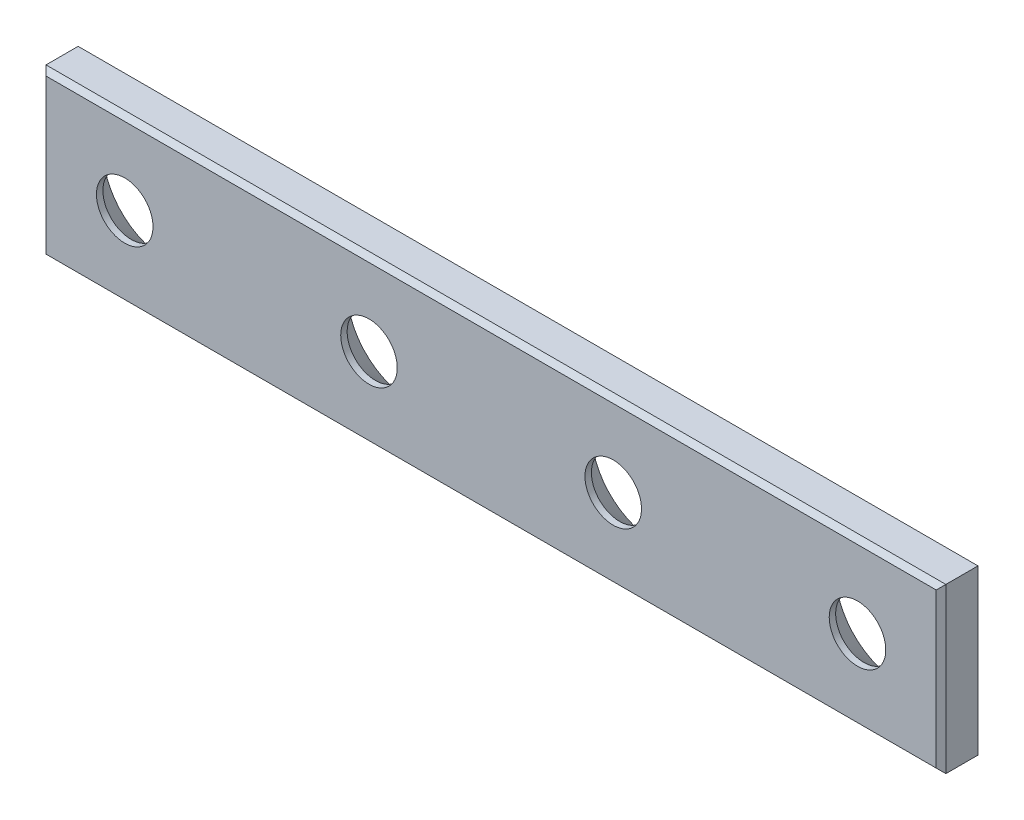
ISO-10303-21;
HEADER;
FILE_DESCRIPTION(('STEP AP214'),'2;1');
FILE_NAME('part.step','',(''),(''),'','','');
FILE_SCHEMA(('AUTOMOTIVE_DESIGN { 1 0 10303 214 1 1 1 1 }'));
ENDSEC;
DATA;
#1=APPLICATION_CONTEXT('core data for automotive mechanical design processes');
#2=APPLICATION_PROTOCOL_DEFINITION('international standard','automotive_design',2000,#1);
#3=PRODUCT_CONTEXT('',#1,'mechanical');
#4=PRODUCT('Part','Part','',(#3));
#5=PRODUCT_RELATED_PRODUCT_CATEGORY('part','',(#4));
#6=PRODUCT_DEFINITION_FORMATION('','',#4);
#7=PRODUCT_DEFINITION_CONTEXT('part definition',#1,'design');
#8=PRODUCT_DEFINITION('design','',#6,#7);
#9=PRODUCT_DEFINITION_SHAPE('','',#8);
#10=(LENGTH_UNIT() NAMED_UNIT(*) SI_UNIT(.MILLI.,.METRE.));
#11=(NAMED_UNIT(*) PLANE_ANGLE_UNIT() SI_UNIT($,.RADIAN.));
#12=(NAMED_UNIT(*) SI_UNIT($,.STERADIAN.) SOLID_ANGLE_UNIT());
#13=UNCERTAINTY_MEASURE_WITH_UNIT(LENGTH_MEASURE(1.E-05),#10,'distance_accuracy_value','');
#14=(GEOMETRIC_REPRESENTATION_CONTEXT(3) GLOBAL_UNCERTAINTY_ASSIGNED_CONTEXT((#13)) GLOBAL_UNIT_ASSIGNED_CONTEXT((#10,
#11,#12)) REPRESENTATION_CONTEXT('',''));
#15=CARTESIAN_POINT('',(0.,0.,0.));
#16=DIRECTION('',(0.,0.,1.));
#17=DIRECTION('',(1.,0.,0.));
#18=AXIS2_PLACEMENT_3D('',#15,#16,#17);
#19=CARTESIAN_POINT('',(70.,-12.75,6.5));
#20=DIRECTION('',(-1.,0.,0.));
#21=DIRECTION('',(0.,0.,1.));
#22=AXIS2_PLACEMENT_3D('',#19,#20,#21);
#23=PLANE('',#22);
#24=DIRECTION('',(0.,0.,-1.));
#25=VECTOR('',#24,1.);
#26=CARTESIAN_POINT('',(70.,12.75,6.5));
#27=LINE('',#26,#25);
#28=CARTESIAN_POINT('',(70.,12.75,5.75));
#29=VERTEX_POINT('',#28);
#30=CARTESIAN_POINT('',(70.,12.75,0.750000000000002));
#31=VERTEX_POINT('',#30);
#32=EDGE_CURVE('E120',#29,#31,#27,.T.);
#33=ORIENTED_EDGE('',*,*,#32,.F.);
#34=DIRECTION('',(0.,-1.,0.));
#35=VECTOR('',#34,1.);
#36=CARTESIAN_POINT('',(70.,-12.75,5.75));
#37=LINE('',#36,#35);
#38=CARTESIAN_POINT('',(70.,-12.75,5.75));
#39=VERTEX_POINT('',#38);
#40=EDGE_CURVE('E144',#29,#39,#37,.T.);
#41=ORIENTED_EDGE('',*,*,#40,.T.);
#42=DIRECTION('',(0.,0.,-1.));
#43=VECTOR('',#42,1.);
#44=CARTESIAN_POINT('',(70.,-12.75,6.5));
#45=LINE('',#44,#43);
#46=CARTESIAN_POINT('',(70.,-12.75,0.750000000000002));
#47=VERTEX_POINT('',#46);
#48=EDGE_CURVE('E158',#39,#47,#45,.T.);
#49=ORIENTED_EDGE('',*,*,#48,.T.);
#50=DIRECTION('',(0.,1.,0.));
#51=VECTOR('',#50,1.);
#52=CARTESIAN_POINT('',(70.,12.75,0.750000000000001));
#53=LINE('',#52,#51);
#54=EDGE_CURVE('E142',#47,#31,#53,.T.);
#55=ORIENTED_EDGE('',*,*,#54,.T.);
#56=EDGE_LOOP('',(#33,#41,#49,#55));
#57=FACE_BOUND('',#56,.T.);
#58=ADVANCED_FACE('F34',(#57),#23,.F.);
#59=CARTESIAN_POINT('',(-70.,12.75,6.5));
#60=DIRECTION('',(0.,-1.,0.));
#61=DIRECTION('',(0.,0.,-1.));
#62=AXIS2_PLACEMENT_3D('',#59,#60,#61);
#63=PLANE('',#62);
#64=DIRECTION('',(0.,0.,-1.));
#65=VECTOR('',#64,1.);
#66=CARTESIAN_POINT('',(-70.,12.75,6.5));
#67=LINE('',#66,#65);
#68=CARTESIAN_POINT('',(-70.,12.75,5.75));
#69=VERTEX_POINT('',#68);
#70=CARTESIAN_POINT('',(-70.,12.75,0.750000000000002));
#71=VERTEX_POINT('',#70);
#72=EDGE_CURVE('E278',#69,#71,#67,.T.);
#73=ORIENTED_EDGE('',*,*,#72,.F.);
#74=DIRECTION('',(1.,0.,0.));
#75=VECTOR('',#74,1.);
#76=CARTESIAN_POINT('',(-70.,12.75,5.75));
#77=LINE('',#76,#75);
#78=EDGE_CURVE('E140',#69,#29,#77,.T.);
#79=ORIENTED_EDGE('',*,*,#78,.T.);
#80=ORIENTED_EDGE('',*,*,#32,.T.);
#81=DIRECTION('',(-1.,0.,0.));
#82=VECTOR('',#81,1.);
#83=CARTESIAN_POINT('',(-70.,12.75,0.750000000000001));
#84=LINE('',#83,#82);
#85=EDGE_CURVE('E137',#31,#71,#84,.T.);
#86=ORIENTED_EDGE('',*,*,#85,.T.);
#87=EDGE_LOOP('',(#73,#79,#80,#86));
#88=FACE_BOUND('',#87,.T.);
#89=ADVANCED_FACE('F205',(#88),#63,.F.);
#90=CARTESIAN_POINT('',(-70.,-12.75,6.5));
#91=DIRECTION('',(1.,0.,0.));
#92=DIRECTION('',(0.,0.,-1.));
#93=AXIS2_PLACEMENT_3D('',#90,#91,#92);
#94=PLANE('',#93);
#95=DIRECTION('',(0.,0.,-1.));
#96=VECTOR('',#95,1.);
#97=CARTESIAN_POINT('',(-70.,-12.75,6.5));
#98=LINE('',#97,#96);
#99=CARTESIAN_POINT('',(-70.,-12.75,5.75));
#100=VERTEX_POINT('',#99);
#101=CARTESIAN_POINT('',(-70.,-12.75,0.750000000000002));
#102=VERTEX_POINT('',#101);
#103=EDGE_CURVE('E275',#100,#102,#98,.T.);
#104=ORIENTED_EDGE('',*,*,#103,.F.);
#105=DIRECTION('',(0.,1.,0.));
#106=VECTOR('',#105,1.);
#107=CARTESIAN_POINT('',(-70.,-12.75,5.75));
#108=LINE('',#107,#106);
#109=EDGE_CURVE('E135',#100,#69,#108,.T.);
#110=ORIENTED_EDGE('',*,*,#109,.T.);
#111=ORIENTED_EDGE('',*,*,#72,.T.);
#112=DIRECTION('',(0.,-1.,0.));
#113=VECTOR('',#112,1.);
#114=CARTESIAN_POINT('',(-70.,-12.75,0.750000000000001));
#115=LINE('',#114,#113);
#116=EDGE_CURVE('E133',#71,#102,#115,.T.);
#117=ORIENTED_EDGE('',*,*,#116,.T.);
#118=EDGE_LOOP('',(#104,#110,#111,#117));
#119=FACE_BOUND('',#118,.T.);
#120=ADVANCED_FACE('F211',(#119),#94,.F.);
#121=CARTESIAN_POINT('',(-70.,-12.75,6.5));
#122=DIRECTION('',(0.,1.,0.));
#123=DIRECTION('',(0.,0.,1.));
#124=AXIS2_PLACEMENT_3D('',#121,#122,#123);
#125=PLANE('',#124);
#126=ORIENTED_EDGE('',*,*,#48,.F.);
#127=DIRECTION('',(-1.,0.,0.));
#128=VECTOR('',#127,1.);
#129=CARTESIAN_POINT('',(-70.,-12.75,5.75));
#130=LINE('',#129,#128);
#131=EDGE_CURVE('E106',#39,#100,#130,.T.);
#132=ORIENTED_EDGE('',*,*,#131,.T.);
#133=ORIENTED_EDGE('',*,*,#103,.T.);
#134=DIRECTION('',(1.,0.,0.));
#135=VECTOR('',#134,1.);
#136=CARTESIAN_POINT('',(70.,-12.75,0.750000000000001));
#137=LINE('',#136,#135);
#138=EDGE_CURVE('E126',#102,#47,#137,.T.);
#139=ORIENTED_EDGE('',*,*,#138,.T.);
#140=EDGE_LOOP('',(#126,#132,#133,#139));
#141=FACE_BOUND('',#140,.T.);
#142=ADVANCED_FACE('F290',(#141),#125,.F.);
#143=CARTESIAN_POINT('',(70.,12.75,6.5));
#144=DIRECTION('',(0.,0.,-1.));
#145=DIRECTION('',(-1.,0.,0.));
#146=AXIS2_PLACEMENT_3D('',#143,#144,#145);
#147=PLANE('',#146);
#148=CARTESIAN_POINT('',(57.,0.,6.5));
#149=DIRECTION('',(0.,0.,-1.));
#150=DIRECTION('',(-1.,0.,0.));
#151=AXIS2_PLACEMENT_3D('',#148,#149,#150);
#152=CIRCLE('',#151,4.4);
#153=CARTESIAN_POINT('',(52.6,0.,6.5));
#154=VERTEX_POINT('',#153);
#155=EDGE_CURVE('E454',#154,#154,#152,.T.);
#156=ORIENTED_EDGE('',*,*,#155,.T.);
#157=EDGE_LOOP('',(#156));
#158=FACE_BOUND('',#157,.T.);
#159=CARTESIAN_POINT('',(19.,0.,6.5));
#160=DIRECTION('',(0.,0.,-1.));
#161=DIRECTION('',(-1.,0.,0.));
#162=AXIS2_PLACEMENT_3D('',#159,#160,#161);
#163=CIRCLE('',#162,4.4);
#164=CARTESIAN_POINT('',(14.6,0.,6.5));
#165=VERTEX_POINT('',#164);
#166=EDGE_CURVE('E269',#165,#165,#163,.T.);
#167=ORIENTED_EDGE('',*,*,#166,.T.);
#168=EDGE_LOOP('',(#167));
#169=FACE_BOUND('',#168,.T.);
#170=CARTESIAN_POINT('',(-19.,0.,6.5));
#171=DIRECTION('',(0.,0.,-1.));
#172=DIRECTION('',(-1.,0.,0.));
#173=AXIS2_PLACEMENT_3D('',#170,#171,#172);
#174=CIRCLE('',#173,4.4);
#175=CARTESIAN_POINT('',(-23.4,0.,6.5));
#176=VERTEX_POINT('',#175);
#177=EDGE_CURVE('E266',#176,#176,#174,.T.);
#178=ORIENTED_EDGE('',*,*,#177,.T.);
#179=EDGE_LOOP('',(#178));
#180=FACE_BOUND('',#179,.T.);
#181=CARTESIAN_POINT('',(-57.,0.,6.5));
#182=DIRECTION('',(0.,0.,-1.));
#183=DIRECTION('',(-1.,0.,0.));
#184=AXIS2_PLACEMENT_3D('',#181,#182,#183);
#185=CIRCLE('',#184,4.4);
#186=CARTESIAN_POINT('',(-61.4,0.,6.5));
#187=VERTEX_POINT('',#186);
#188=EDGE_CURVE('E162',#187,#187,#185,.T.);
#189=ORIENTED_EDGE('',*,*,#188,.T.);
#190=EDGE_LOOP('',(#189));
#191=FACE_BOUND('',#190,.T.);
#192=DIRECTION('',(0.,-1.,0.));
#193=VECTOR('',#192,1.);
#194=CARTESIAN_POINT('',(-69.25,12.75,6.5));
#195=LINE('',#194,#193);
#196=CARTESIAN_POINT('',(-69.25,12.,6.5));
#197=VERTEX_POINT('',#196);
#198=CARTESIAN_POINT('',(-69.25,-12.,6.5));
#199=VERTEX_POINT('',#198);
#200=EDGE_CURVE('E124',#197,#199,#195,.T.);
#201=ORIENTED_EDGE('',*,*,#200,.T.);
#202=DIRECTION('',(1.,0.,0.));
#203=VECTOR('',#202,1.);
#204=CARTESIAN_POINT('',(70.,-12.,6.5));
#205=LINE('',#204,#203);
#206=CARTESIAN_POINT('',(69.25,-12.,6.5));
#207=VERTEX_POINT('',#206);
#208=EDGE_CURVE('E104',#199,#207,#205,.T.);
#209=ORIENTED_EDGE('',*,*,#208,.T.);
#210=DIRECTION('',(0.,1.,0.));
#211=VECTOR('',#210,1.);
#212=CARTESIAN_POINT('',(69.25,12.75,6.5));
#213=LINE('',#212,#211);
#214=CARTESIAN_POINT('',(69.25,12.,6.5));
#215=VERTEX_POINT('',#214);
#216=EDGE_CURVE('E113',#207,#215,#213,.T.);
#217=ORIENTED_EDGE('',*,*,#216,.T.);
#218=DIRECTION('',(-1.,0.,0.));
#219=VECTOR('',#218,1.);
#220=CARTESIAN_POINT('',(70.,12.,6.5));
#221=LINE('',#220,#219);
#222=EDGE_CURVE('E119',#215,#197,#221,.T.);
#223=ORIENTED_EDGE('',*,*,#222,.T.);
#224=EDGE_LOOP('',(#201,#209,#217,#223));
#225=FACE_BOUND('',#224,.T.);
#226=ADVANCED_FACE('F122',(#158,#169,#180,#191,#225),#147,.F.);
#227=CARTESIAN_POINT('',(70.,12.75,0.));
#228=DIRECTION('',(0.,0.,-1.));
#229=DIRECTION('',(-1.,0.,0.));
#230=AXIS2_PLACEMENT_3D('',#227,#228,#229);
#231=PLANE('',#230);
#232=CARTESIAN_POINT('',(-57.,0.,0.));
#233=DIRECTION('',(0.,0.,-1.));
#234=DIRECTION('',(-1.,0.,0.));
#235=AXIS2_PLACEMENT_3D('',#232,#233,#234);
#236=CIRCLE('',#235,9.90000000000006);
#237=CARTESIAN_POINT('',(-66.9000000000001,0.,0.));
#238=VERTEX_POINT('',#237);
#239=EDGE_CURVE('E180',#238,#238,#236,.F.);
#240=ORIENTED_EDGE('',*,*,#239,.T.);
#241=EDGE_LOOP('',(#240));
#242=FACE_BOUND('',#241,.T.);
#243=CARTESIAN_POINT('',(-19.,0.,0.));
#244=DIRECTION('',(0.,0.,-1.));
#245=DIRECTION('',(-1.,0.,0.));
#246=AXIS2_PLACEMENT_3D('',#243,#244,#245);
#247=CIRCLE('',#246,9.90000000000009);
#248=CARTESIAN_POINT('',(-28.9000000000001,0.,0.));
#249=VERTEX_POINT('',#248);
#250=EDGE_CURVE('E177',#249,#249,#247,.F.);
#251=ORIENTED_EDGE('',*,*,#250,.T.);
#252=EDGE_LOOP('',(#251));
#253=FACE_BOUND('',#252,.T.);
#254=CARTESIAN_POINT('',(19.,0.,0.));
#255=DIRECTION('',(0.,0.,-1.));
#256=DIRECTION('',(-1.,0.,0.));
#257=AXIS2_PLACEMENT_3D('',#254,#255,#256);
#258=CIRCLE('',#257,9.90000000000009);
#259=CARTESIAN_POINT('',(9.09999999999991,0.,0.));
#260=VERTEX_POINT('',#259);
#261=EDGE_CURVE('E174',#260,#260,#258,.F.);
#262=ORIENTED_EDGE('',*,*,#261,.T.);
#263=EDGE_LOOP('',(#262));
#264=FACE_BOUND('',#263,.T.);
#265=CARTESIAN_POINT('',(57.,0.,0.));
#266=DIRECTION('',(0.,0.,-1.));
#267=DIRECTION('',(-1.,0.,0.));
#268=AXIS2_PLACEMENT_3D('',#265,#266,#267);
#269=CIRCLE('',#268,9.9000000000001);
#270=CARTESIAN_POINT('',(47.0999999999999,0.,0.));
#271=VERTEX_POINT('',#270);
#272=EDGE_CURVE('E171',#271,#271,#269,.F.);
#273=ORIENTED_EDGE('',*,*,#272,.T.);
#274=EDGE_LOOP('',(#273));
#275=FACE_BOUND('',#274,.T.);
#276=DIRECTION('',(0.,1.,0.));
#277=VECTOR('',#276,1.);
#278=CARTESIAN_POINT('',(-69.25,12.75,0.));
#279=LINE('',#278,#277);
#280=CARTESIAN_POINT('',(-69.25,-12.,0.));
#281=VERTEX_POINT('',#280);
#282=CARTESIAN_POINT('',(-69.25,12.,0.));
#283=VERTEX_POINT('',#282);
#284=EDGE_CURVE('E49',#281,#283,#279,.T.);
#285=ORIENTED_EDGE('',*,*,#284,.T.);
#286=DIRECTION('',(1.,0.,0.));
#287=VECTOR('',#286,1.);
#288=CARTESIAN_POINT('',(70.,12.,0.));
#289=LINE('',#288,#287);
#290=CARTESIAN_POINT('',(69.25,12.,0.));
#291=VERTEX_POINT('',#290);
#292=EDGE_CURVE('E150',#283,#291,#289,.T.);
#293=ORIENTED_EDGE('',*,*,#292,.T.);
#294=DIRECTION('',(0.,-1.,0.));
#295=VECTOR('',#294,1.);
#296=CARTESIAN_POINT('',(69.25,-12.75,0.));
#297=LINE('',#296,#295);
#298=CARTESIAN_POINT('',(69.25,-12.,0.));
#299=VERTEX_POINT('',#298);
#300=EDGE_CURVE('E146',#291,#299,#297,.T.);
#301=ORIENTED_EDGE('',*,*,#300,.T.);
#302=DIRECTION('',(-1.,0.,0.));
#303=VECTOR('',#302,1.);
#304=CARTESIAN_POINT('',(-70.,-12.,0.));
#305=LINE('',#304,#303);
#306=EDGE_CURVE('E54',#299,#281,#305,.T.);
#307=ORIENTED_EDGE('',*,*,#306,.T.);
#308=EDGE_LOOP('',(#285,#293,#301,#307));
#309=FACE_BOUND('',#308,.T.);
#310=ADVANCED_FACE('F229',(#242,#253,#264,#275,#309),#231,.T.);
#311=CARTESIAN_POINT('',(70.,12.,6.5));
#312=DIRECTION('',(0.,-0.707106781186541,-0.707106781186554));
#313=DIRECTION('',(0.,0.707106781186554,-0.707106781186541));
#314=AXIS2_PLACEMENT_3D('',#311,#312,#313);
#315=PLANE('',#314);
#316=DIRECTION('',(-0.577350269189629,-0.577350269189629,0.577350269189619));
#317=VECTOR('',#316,1.);
#318=CARTESIAN_POINT('',(69.5,12.25,6.25));
#319=LINE('',#318,#317);
#320=EDGE_CURVE('E116',#29,#215,#319,.T.);
#321=ORIENTED_EDGE('',*,*,#320,.F.);
#322=ORIENTED_EDGE('',*,*,#78,.F.);
#323=DIRECTION('',(0.577350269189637,-0.577350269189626,0.577350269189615));
#324=VECTOR('',#323,1.);
#325=CARTESIAN_POINT('',(-22.8333333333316,-34.4166666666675,52.9166666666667));
#326=LINE('',#325,#324);
#327=EDGE_CURVE('E155',#197,#69,#326,.F.);
#328=ORIENTED_EDGE('',*,*,#327,.F.);
#329=ORIENTED_EDGE('',*,*,#222,.F.);
#330=EDGE_LOOP('',(#321,#322,#328,#329));
#331=FACE_BOUND('',#330,.T.);
#332=ADVANCED_FACE('F225',(#331),#315,.F.);
#333=CARTESIAN_POINT('',(-69.25,12.75,6.5));
#334=DIRECTION('',(0.707106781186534,0.,-0.707106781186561));
#335=DIRECTION('',(-0.707106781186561,0.,-0.707106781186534));
#336=AXIS2_PLACEMENT_3D('',#333,#334,#335);
#337=PLANE('',#336);
#338=ORIENTED_EDGE('',*,*,#327,.T.);
#339=ORIENTED_EDGE('',*,*,#109,.F.);
#340=DIRECTION('',(0.577350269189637,0.577350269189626,0.577350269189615));
#341=VECTOR('',#340,1.);
#342=CARTESIAN_POINT('',(-60.9999999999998,-3.74999999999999,14.7499999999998));
#343=LINE('',#342,#341);
#344=EDGE_CURVE('E109',#199,#100,#343,.F.);
#345=ORIENTED_EDGE('',*,*,#344,.F.);
#346=ORIENTED_EDGE('',*,*,#200,.F.);
#347=EDGE_LOOP('',(#338,#339,#345,#346));
#348=FACE_BOUND('',#347,.T.);
#349=ADVANCED_FACE('F222',(#348),#337,.F.);
#350=CARTESIAN_POINT('',(69.25,12.75,6.5));
#351=DIRECTION('',(-0.707106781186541,0.,-0.707106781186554));
#352=DIRECTION('',(-0.707106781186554,0.,0.707106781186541));
#353=AXIS2_PLACEMENT_3D('',#350,#351,#352);
#354=PLANE('',#353);
#355=ORIENTED_EDGE('',*,*,#320,.T.);
#356=ORIENTED_EDGE('',*,*,#216,.F.);
#357=DIRECTION('',(0.577350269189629,-0.577350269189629,-0.577350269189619));
#358=VECTOR('',#357,1.);
#359=CARTESIAN_POINT('',(60.9999999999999,-3.74999999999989,14.7499999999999));
#360=LINE('',#359,#358);
#361=EDGE_CURVE('E100',#39,#207,#360,.F.);
#362=ORIENTED_EDGE('',*,*,#361,.F.);
#363=ORIENTED_EDGE('',*,*,#40,.F.);
#364=EDGE_LOOP('',(#355,#356,#362,#363));
#365=FACE_BOUND('',#364,.T.);
#366=ADVANCED_FACE('F114',(#365),#354,.F.);
#367=CARTESIAN_POINT('',(70.,-12.,6.5));
#368=DIRECTION('',(0.,0.707106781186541,-0.707106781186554));
#369=DIRECTION('',(0.,0.707106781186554,0.707106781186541));
#370=AXIS2_PLACEMENT_3D('',#367,#368,#369);
#371=PLANE('',#370);
#372=ORIENTED_EDGE('',*,*,#344,.T.);
#373=ORIENTED_EDGE('',*,*,#131,.F.);
#374=ORIENTED_EDGE('',*,*,#361,.T.);
#375=ORIENTED_EDGE('',*,*,#208,.F.);
#376=EDGE_LOOP('',(#372,#373,#374,#375));
#377=FACE_BOUND('',#376,.T.);
#378=ADVANCED_FACE('F102',(#377),#371,.F.);
#379=CARTESIAN_POINT('',(-70.,-12.75,0.750000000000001));
#380=DIRECTION('',(0.,-0.707106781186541,-0.707106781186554));
#381=DIRECTION('',(0.,0.707106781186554,-0.707106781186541));
#382=AXIS2_PLACEMENT_3D('',#379,#380,#381);
#383=PLANE('',#382);
#384=DIRECTION('',(0.577350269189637,0.577350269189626,-0.577350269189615));
#385=VECTOR('',#384,1.);
#386=CARTESIAN_POINT('',(-70.,-12.75,0.750000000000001));
#387=LINE('',#386,#385);
#388=EDGE_CURVE('E164',#281,#102,#387,.F.);
#389=ORIENTED_EDGE('',*,*,#388,.F.);
#390=ORIENTED_EDGE('',*,*,#306,.F.);
#391=DIRECTION('',(-0.577350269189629,0.577350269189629,-0.577350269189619));
#392=VECTOR('',#391,1.);
#393=CARTESIAN_POINT('',(70.,-12.75,0.750000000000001));
#394=LINE('',#393,#392);
#395=EDGE_CURVE('E110',#47,#299,#394,.T.);
#396=ORIENTED_EDGE('',*,*,#395,.F.);
#397=ORIENTED_EDGE('',*,*,#138,.F.);
#398=EDGE_LOOP('',(#389,#390,#396,#397));
#399=FACE_BOUND('',#398,.T.);
#400=ADVANCED_FACE('F219',(#399),#383,.T.);
#401=CARTESIAN_POINT('',(70.,-12.75,0.750000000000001));
#402=DIRECTION('',(0.707106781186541,0.,-0.707106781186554));
#403=DIRECTION('',(-0.707106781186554,0.,-0.707106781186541));
#404=AXIS2_PLACEMENT_3D('',#401,#402,#403);
#405=PLANE('',#404);
#406=ORIENTED_EDGE('',*,*,#395,.T.);
#407=ORIENTED_EDGE('',*,*,#300,.F.);
#408=DIRECTION('',(0.577350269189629,0.577350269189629,0.577350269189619));
#409=VECTOR('',#408,1.);
#410=CARTESIAN_POINT('',(61.4999999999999,4.24999999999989,-7.74999999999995));
#411=LINE('',#410,#409);
#412=EDGE_CURVE('E161',#31,#291,#411,.F.);
#413=ORIENTED_EDGE('',*,*,#412,.F.);
#414=ORIENTED_EDGE('',*,*,#54,.F.);
#415=EDGE_LOOP('',(#406,#407,#413,#414));
#416=FACE_BOUND('',#415,.T.);
#417=ADVANCED_FACE('F239',(#416),#405,.T.);
#418=CARTESIAN_POINT('',(-70.,-12.75,0.750000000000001));
#419=DIRECTION('',(-0.707106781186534,0.,-0.707106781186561));
#420=DIRECTION('',(-0.707106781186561,0.,0.707106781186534));
#421=AXIS2_PLACEMENT_3D('',#418,#419,#420);
#422=PLANE('',#421);
#423=ORIENTED_EDGE('',*,*,#388,.T.);
#424=ORIENTED_EDGE('',*,*,#116,.F.);
#425=DIRECTION('',(0.577350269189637,-0.577350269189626,-0.577350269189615));
#426=VECTOR('',#425,1.);
#427=CARTESIAN_POINT('',(-61.4999999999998,4.25,-7.74999999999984));
#428=LINE('',#427,#426);
#429=EDGE_CURVE('E159',#283,#71,#428,.F.);
#430=ORIENTED_EDGE('',*,*,#429,.F.);
#431=ORIENTED_EDGE('',*,*,#284,.F.);
#432=EDGE_LOOP('',(#423,#424,#430,#431));
#433=FACE_BOUND('',#432,.T.);
#434=ADVANCED_FACE('F235',(#433),#422,.T.);
#435=CARTESIAN_POINT('',(-70.,12.75,0.750000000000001));
#436=DIRECTION('',(0.,0.707106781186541,-0.707106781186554));
#437=DIRECTION('',(0.,0.707106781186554,0.707106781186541));
#438=AXIS2_PLACEMENT_3D('',#435,#436,#437);
#439=PLANE('',#438);
#440=ORIENTED_EDGE('',*,*,#412,.T.);
#441=ORIENTED_EDGE('',*,*,#292,.F.);
#442=ORIENTED_EDGE('',*,*,#429,.T.);
#443=ORIENTED_EDGE('',*,*,#85,.F.);
#444=EDGE_LOOP('',(#440,#441,#442,#443));
#445=FACE_BOUND('',#444,.T.);
#446=ADVANCED_FACE('F231',(#445),#439,.T.);
#447=CARTESIAN_POINT('',(-57.,0.,6.5));
#448=DIRECTION('',(0.,0.,-1.));
#449=DIRECTION('',(-1.,0.,0.));
#450=AXIS2_PLACEMENT_3D('',#447,#448,#449);
#451=CYLINDRICAL_SURFACE('',#450,4.4);
#452=CARTESIAN_POINT('',(-57.,0.,5.50000000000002));
#453=DIRECTION('',(0.,0.,-1.));
#454=DIRECTION('',(-1.,0.,0.));
#455=AXIS2_PLACEMENT_3D('',#452,#453,#454);
#456=CIRCLE('',#455,4.4);
#457=CARTESIAN_POINT('',(-61.4,0.,5.50000000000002));
#458=VERTEX_POINT('',#457);
#459=EDGE_CURVE('E151',#458,#458,#456,.T.);
#460=CARTESIAN_POINT('',(-61.4,0.,5.50000000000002));
#461=CARTESIAN_POINT('',(-61.4,0.,5.51041666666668));
#462=CARTESIAN_POINT('',(-61.4,0.,5.52083333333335));
#463=CARTESIAN_POINT('',(-61.4,0.,5.54166666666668));
#464=CARTESIAN_POINT('',(-61.4,0.,5.55208333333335));
#465=CARTESIAN_POINT('',(-61.4,0.,5.57291666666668));
#466=CARTESIAN_POINT('',(-61.4,0.,5.58333333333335));
#467=CARTESIAN_POINT('',(-61.4,0.,5.60416666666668));
#468=CARTESIAN_POINT('',(-61.4,0.,5.61458333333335));
#469=CARTESIAN_POINT('',(-61.4,0.,5.63541666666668));
#470=CARTESIAN_POINT('',(-61.4,0.,5.64583333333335));
#471=CARTESIAN_POINT('',(-61.4,0.,5.66666666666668));
#472=CARTESIAN_POINT('',(-61.4,0.,5.67708333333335));
#473=CARTESIAN_POINT('',(-61.4,0.,5.69791666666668));
#474=CARTESIAN_POINT('',(-61.4,0.,5.70833333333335));
#475=CARTESIAN_POINT('',(-61.4,0.,5.72916666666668));
#476=CARTESIAN_POINT('',(-61.4,0.,5.73958333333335));
#477=CARTESIAN_POINT('',(-61.4,0.,5.76041666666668));
#478=CARTESIAN_POINT('',(-61.4,0.,5.77083333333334));
#479=CARTESIAN_POINT('',(-61.4,0.,5.79166666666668));
#480=CARTESIAN_POINT('',(-61.4,0.,5.80208333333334));
#481=CARTESIAN_POINT('',(-61.4,0.,5.82291666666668));
#482=CARTESIAN_POINT('',(-61.4,0.,5.83333333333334));
#483=CARTESIAN_POINT('',(-61.4,0.,5.85416666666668));
#484=CARTESIAN_POINT('',(-61.4,0.,5.86458333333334));
#485=CARTESIAN_POINT('',(-61.4,0.,5.88541666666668));
#486=CARTESIAN_POINT('',(-61.4,0.,5.89583333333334));
#487=CARTESIAN_POINT('',(-61.4,0.,5.91666666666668));
#488=CARTESIAN_POINT('',(-61.4,0.,5.92708333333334));
#489=CARTESIAN_POINT('',(-61.4,0.,5.94791666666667));
#490=CARTESIAN_POINT('',(-61.4,0.,5.95833333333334));
#491=CARTESIAN_POINT('',(-61.4,0.,5.97916666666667));
#492=CARTESIAN_POINT('',(-61.4,0.,5.98958333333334));
#493=CARTESIAN_POINT('',(-61.4,0.,6.01041666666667));
#494=CARTESIAN_POINT('',(-61.4,0.,6.02083333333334));
#495=CARTESIAN_POINT('',(-61.4,0.,6.04166666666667));
#496=CARTESIAN_POINT('',(-61.4,0.,6.05208333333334));
#497=CARTESIAN_POINT('',(-61.4,0.,6.07291666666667));
#498=CARTESIAN_POINT('',(-61.4,0.,6.08333333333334));
#499=CARTESIAN_POINT('',(-61.4,0.,6.10416666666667));
#500=CARTESIAN_POINT('',(-61.4,0.,6.11458333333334));
#501=CARTESIAN_POINT('',(-61.4,0.,6.13541666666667));
#502=CARTESIAN_POINT('',(-61.4,0.,6.14583333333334));
#503=CARTESIAN_POINT('',(-61.4,0.,6.16666666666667));
#504=CARTESIAN_POINT('',(-61.4,0.,6.17708333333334));
#505=CARTESIAN_POINT('',(-61.4,0.,6.19791666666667));
#506=CARTESIAN_POINT('',(-61.4,0.,6.20833333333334));
#507=CARTESIAN_POINT('',(-61.4,0.,6.22916666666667));
#508=CARTESIAN_POINT('',(-61.4,0.,6.23958333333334));
#509=CARTESIAN_POINT('',(-61.4,0.,6.26041666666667));
#510=CARTESIAN_POINT('',(-61.4,0.,6.27083333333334));
#511=CARTESIAN_POINT('',(-61.4,0.,6.29166666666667));
#512=CARTESIAN_POINT('',(-61.4,0.,6.30208333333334));
#513=CARTESIAN_POINT('',(-61.4,0.,6.32291666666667));
#514=CARTESIAN_POINT('',(-61.4,0.,6.33333333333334));
#515=CARTESIAN_POINT('',(-61.4,0.,6.35416666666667));
#516=CARTESIAN_POINT('',(-61.4,0.,6.36458333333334));
#517=CARTESIAN_POINT('',(-61.4,0.,6.38541666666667));
#518=CARTESIAN_POINT('',(-61.4,0.,6.39583333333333));
#519=CARTESIAN_POINT('',(-61.4,0.,6.41666666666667));
#520=CARTESIAN_POINT('',(-61.4,0.,6.42708333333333));
#521=CARTESIAN_POINT('',(-61.4,0.,6.44791666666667));
#522=CARTESIAN_POINT('',(-61.4,0.,6.45833333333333));
#523=CARTESIAN_POINT('',(-61.4,0.,6.47916666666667));
#524=CARTESIAN_POINT('',(-61.4,0.,6.48958333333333));
#525=CARTESIAN_POINT('',(-61.4,0.,6.5));
#526=B_SPLINE_CURVE_WITH_KNOTS('',3,(#460,#461,#462,#463,#464,#465,#466,#467,#468,#469,#470,
#471,#472,#473,#474,#475,#476,#477,#478,#479,#480,#481,#482,#483,#484,#485,#486,#487,#488,#489,
#490,#491,#492,#493,#494,#495,#496,#497,#498,#499,#500,#501,#502,#503,#504,#505,#506,#507,#508,
#509,#510,#511,#512,#513,#514,#515,#516,#517,#518,#519,#520,#521,#522,#523,#524,#525),
.UNSPECIFIED.,.F.,.F.,(4,2,2,2,2,2,2,2,2,2,2,2,2,2,2,2,2,2,2,2,2,2,2,2,2,2,2,2,2,2,2,2,4),(0.,
0.0312499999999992,0.0624999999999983,0.0937499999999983,0.124999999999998,0.156249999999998,
0.187499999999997,0.218749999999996,0.249999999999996,0.281249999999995,0.312499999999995,
0.343749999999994,0.374999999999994,0.406249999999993,0.437499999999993,0.468749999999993,
0.499999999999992,0.531249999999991,0.562499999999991,0.59374999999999,0.62499999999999,
0.656249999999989,0.687499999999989,0.718749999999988,0.749999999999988,0.781249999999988,
0.812499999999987,0.843749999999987,0.874999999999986,0.906249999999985,0.937499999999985,
0.968749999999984,0.999999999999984),.UNSPECIFIED.);
#527=EDGE_CURVE('BSEAM234',#458,#187,#526,.T.);
#528=ORIENTED_EDGE('',*,*,#459,.T.);
#529=ORIENTED_EDGE('',*,*,#188,.F.);
#530=ORIENTED_EDGE('',*,*,#527,.T.);
#531=ORIENTED_EDGE('',*,*,#527,.F.);
#532=EDGE_LOOP('',(#528,#530,#529,#531));
#533=FACE_BOUND('',#532,.T.);
#534=ADVANCED_FACE('F234',(#533),#451,.F.);
#535=CARTESIAN_POINT('',(-19.,0.,6.5));
#536=DIRECTION('',(0.,0.,-1.));
#537=DIRECTION('',(-1.,0.,0.));
#538=AXIS2_PLACEMENT_3D('',#535,#536,#537);
#539=CYLINDRICAL_SURFACE('',#538,4.4);
#540=CARTESIAN_POINT('',(-19.,0.,5.50000000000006));
#541=DIRECTION('',(0.,0.,-1.));
#542=DIRECTION('',(-1.,0.,0.));
#543=AXIS2_PLACEMENT_3D('',#540,#541,#542);
#544=CIRCLE('',#543,4.4);
#545=CARTESIAN_POINT('',(-23.4,0.,5.50000000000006));
#546=VERTEX_POINT('',#545);
#547=EDGE_CURVE('E183',#546,#546,#544,.T.);
#548=CARTESIAN_POINT('',(-23.4,0.,5.50000000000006));
#549=CARTESIAN_POINT('',(-23.4,0.,5.51041666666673));
#550=CARTESIAN_POINT('',(-23.4,0.,5.52083333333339));
#551=CARTESIAN_POINT('',(-23.4,0.,5.54166666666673));
#552=CARTESIAN_POINT('',(-23.4,0.,5.55208333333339));
#553=CARTESIAN_POINT('',(-23.4,0.,5.57291666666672));
#554=CARTESIAN_POINT('',(-23.4,0.,5.58333333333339));
#555=CARTESIAN_POINT('',(-23.4,0.,5.60416666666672));
#556=CARTESIAN_POINT('',(-23.4,0.,5.61458333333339));
#557=CARTESIAN_POINT('',(-23.4,0.,5.63541666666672));
#558=CARTESIAN_POINT('',(-23.4,0.,5.64583333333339));
#559=CARTESIAN_POINT('',(-23.4,0.,5.66666666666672));
#560=CARTESIAN_POINT('',(-23.4,0.,5.67708333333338));
#561=CARTESIAN_POINT('',(-23.4,0.,5.69791666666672));
#562=CARTESIAN_POINT('',(-23.4,0.,5.70833333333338));
#563=CARTESIAN_POINT('',(-23.4,0.,5.72916666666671));
#564=CARTESIAN_POINT('',(-23.4,0.,5.73958333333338));
#565=CARTESIAN_POINT('',(-23.4,0.,5.76041666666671));
#566=CARTESIAN_POINT('',(-23.4,0.,5.77083333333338));
#567=CARTESIAN_POINT('',(-23.4,0.,5.79166666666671));
#568=CARTESIAN_POINT('',(-23.4,0.,5.80208333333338));
#569=CARTESIAN_POINT('',(-23.4,0.,5.82291666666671));
#570=CARTESIAN_POINT('',(-23.4,0.,5.83333333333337));
#571=CARTESIAN_POINT('',(-23.4,0.,5.85416666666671));
#572=CARTESIAN_POINT('',(-23.4,0.,5.86458333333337));
#573=CARTESIAN_POINT('',(-23.4,0.,5.8854166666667));
#574=CARTESIAN_POINT('',(-23.4,0.,5.89583333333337));
#575=CARTESIAN_POINT('',(-23.4,0.,5.9166666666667));
#576=CARTESIAN_POINT('',(-23.4,0.,5.92708333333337));
#577=CARTESIAN_POINT('',(-23.4,0.,5.9479166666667));
#578=CARTESIAN_POINT('',(-23.4,0.,5.95833333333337));
#579=CARTESIAN_POINT('',(-23.4,0.,5.9791666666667));
#580=CARTESIAN_POINT('',(-23.4,0.,5.98958333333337));
#581=CARTESIAN_POINT('',(-23.4,0.,6.0104166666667));
#582=CARTESIAN_POINT('',(-23.4,0.,6.02083333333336));
#583=CARTESIAN_POINT('',(-23.4,0.,6.0416666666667));
#584=CARTESIAN_POINT('',(-23.4,0.,6.05208333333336));
#585=CARTESIAN_POINT('',(-23.4,0.,6.07291666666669));
#586=CARTESIAN_POINT('',(-23.4,0.,6.08333333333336));
#587=CARTESIAN_POINT('',(-23.4,0.,6.10416666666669));
#588=CARTESIAN_POINT('',(-23.4,0.,6.11458333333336));
#589=CARTESIAN_POINT('',(-23.4,0.,6.13541666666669));
#590=CARTESIAN_POINT('',(-23.4,0.,6.14583333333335));
#591=CARTESIAN_POINT('',(-23.4,0.,6.16666666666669));
#592=CARTESIAN_POINT('',(-23.4,0.,6.17708333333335));
#593=CARTESIAN_POINT('',(-23.4,0.,6.19791666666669));
#594=CARTESIAN_POINT('',(-23.4,0.,6.20833333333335));
#595=CARTESIAN_POINT('',(-23.4,0.,6.22916666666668));
#596=CARTESIAN_POINT('',(-23.4,0.,6.23958333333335));
#597=CARTESIAN_POINT('',(-23.4,0.,6.26041666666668));
#598=CARTESIAN_POINT('',(-23.4,0.,6.27083333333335));
#599=CARTESIAN_POINT('',(-23.4,0.,6.29166666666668));
#600=CARTESIAN_POINT('',(-23.4,0.,6.30208333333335));
#601=CARTESIAN_POINT('',(-23.4,0.,6.32291666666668));
#602=CARTESIAN_POINT('',(-23.4,0.,6.33333333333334));
#603=CARTESIAN_POINT('',(-23.4,0.,6.35416666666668));
#604=CARTESIAN_POINT('',(-23.4,0.,6.36458333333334));
#605=CARTESIAN_POINT('',(-23.4,0.,6.38541666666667));
#606=CARTESIAN_POINT('',(-23.4,0.,6.39583333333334));
#607=CARTESIAN_POINT('',(-23.4,0.,6.41666666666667));
#608=CARTESIAN_POINT('',(-23.4,0.,6.42708333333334));
#609=CARTESIAN_POINT('',(-23.4,0.,6.44791666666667));
#610=CARTESIAN_POINT('',(-23.4,0.,6.45833333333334));
#611=CARTESIAN_POINT('',(-23.4,0.,6.47916666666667));
#612=CARTESIAN_POINT('',(-23.4,0.,6.48958333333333));
#613=CARTESIAN_POINT('',(-23.4,0.,6.5));
#614=B_SPLINE_CURVE_WITH_KNOTS('',3,(#548,#549,#550,#551,#552,#553,#554,#555,#556,#557,#558,
#559,#560,#561,#562,#563,#564,#565,#566,#567,#568,#569,#570,#571,#572,#573,#574,#575,#576,#577,
#578,#579,#580,#581,#582,#583,#584,#585,#586,#587,#588,#589,#590,#591,#592,#593,#594,#595,#596,
#597,#598,#599,#600,#601,#602,#603,#604,#605,#606,#607,#608,#609,#610,#611,#612,#613),
.UNSPECIFIED.,.F.,.F.,(4,2,2,2,2,2,2,2,2,2,2,2,2,2,2,2,2,2,2,2,2,2,2,2,2,2,2,2,2,2,2,2,4),(0.,
0.0312499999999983,0.0624999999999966,0.093749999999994,0.124999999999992,0.156249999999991,
0.187499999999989,0.218749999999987,0.249999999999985,0.281249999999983,0.312499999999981,
0.343749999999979,0.374999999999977,0.406249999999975,0.437499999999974,0.468749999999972,
0.499999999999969,0.531249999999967,0.562499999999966,0.593749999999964,0.624999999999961,
0.65624999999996,0.687499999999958,0.718749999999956,0.749999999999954,0.781249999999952,
0.81249999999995,0.843749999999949,0.874999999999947,0.906249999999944,0.937499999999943,
0.968749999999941,0.999999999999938),.UNSPECIFIED.);
#615=EDGE_CURVE('BSEAM261',#546,#176,#614,.T.);
#616=ORIENTED_EDGE('',*,*,#547,.T.);
#617=ORIENTED_EDGE('',*,*,#177,.F.);
#618=ORIENTED_EDGE('',*,*,#615,.T.);
#619=ORIENTED_EDGE('',*,*,#615,.F.);
#620=EDGE_LOOP('',(#616,#618,#617,#619));
#621=FACE_BOUND('',#620,.T.);
#622=ADVANCED_FACE('F261',(#621),#539,.F.);
#623=CARTESIAN_POINT('',(19.,0.,6.5));
#624=DIRECTION('',(0.,0.,-1.));
#625=DIRECTION('',(-1.,0.,0.));
#626=AXIS2_PLACEMENT_3D('',#623,#624,#625);
#627=CYLINDRICAL_SURFACE('',#626,4.4);
#628=CARTESIAN_POINT('',(19.,0.,5.50000000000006));
#629=DIRECTION('',(0.,0.,-1.));
#630=DIRECTION('',(-1.,0.,0.));
#631=AXIS2_PLACEMENT_3D('',#628,#629,#630);
#632=CIRCLE('',#631,4.4);
#633=CARTESIAN_POINT('',(14.6,0.,5.50000000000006));
#634=VERTEX_POINT('',#633);
#635=EDGE_CURVE('E42',#634,#634,#632,.T.);
#636=CARTESIAN_POINT('',(14.6,0.,5.50000000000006));
#637=CARTESIAN_POINT('',(14.6,0.,5.51041666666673));
#638=CARTESIAN_POINT('',(14.6,0.,5.52083333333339));
#639=CARTESIAN_POINT('',(14.6,0.,5.54166666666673));
#640=CARTESIAN_POINT('',(14.6,0.,5.55208333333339));
#641=CARTESIAN_POINT('',(14.6,0.,5.57291666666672));
#642=CARTESIAN_POINT('',(14.6,0.,5.58333333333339));
#643=CARTESIAN_POINT('',(14.6,0.,5.60416666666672));
#644=CARTESIAN_POINT('',(14.6,0.,5.61458333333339));
#645=CARTESIAN_POINT('',(14.6,0.,5.63541666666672));
#646=CARTESIAN_POINT('',(14.6,0.,5.64583333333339));
#647=CARTESIAN_POINT('',(14.6,0.,5.66666666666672));
#648=CARTESIAN_POINT('',(14.6,0.,5.67708333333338));
#649=CARTESIAN_POINT('',(14.6,0.,5.69791666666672));
#650=CARTESIAN_POINT('',(14.6,0.,5.70833333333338));
#651=CARTESIAN_POINT('',(14.6,0.,5.72916666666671));
#652=CARTESIAN_POINT('',(14.6,0.,5.73958333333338));
#653=CARTESIAN_POINT('',(14.6,0.,5.76041666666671));
#654=CARTESIAN_POINT('',(14.6,0.,5.77083333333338));
#655=CARTESIAN_POINT('',(14.6,0.,5.79166666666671));
#656=CARTESIAN_POINT('',(14.6,0.,5.80208333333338));
#657=CARTESIAN_POINT('',(14.6,0.,5.82291666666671));
#658=CARTESIAN_POINT('',(14.6,0.,5.83333333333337));
#659=CARTESIAN_POINT('',(14.6,0.,5.85416666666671));
#660=CARTESIAN_POINT('',(14.6,0.,5.86458333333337));
#661=CARTESIAN_POINT('',(14.6,0.,5.8854166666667));
#662=CARTESIAN_POINT('',(14.6,0.,5.89583333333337));
#663=CARTESIAN_POINT('',(14.6,0.,5.9166666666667));
#664=CARTESIAN_POINT('',(14.6,0.,5.92708333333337));
#665=CARTESIAN_POINT('',(14.6,0.,5.9479166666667));
#666=CARTESIAN_POINT('',(14.6,0.,5.95833333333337));
#667=CARTESIAN_POINT('',(14.6,0.,5.9791666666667));
#668=CARTESIAN_POINT('',(14.6,0.,5.98958333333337));
#669=CARTESIAN_POINT('',(14.6,0.,6.0104166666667));
#670=CARTESIAN_POINT('',(14.6,0.,6.02083333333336));
#671=CARTESIAN_POINT('',(14.6,0.,6.0416666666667));
#672=CARTESIAN_POINT('',(14.6,0.,6.05208333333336));
#673=CARTESIAN_POINT('',(14.6,0.,6.07291666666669));
#674=CARTESIAN_POINT('',(14.6,0.,6.08333333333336));
#675=CARTESIAN_POINT('',(14.6,0.,6.10416666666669));
#676=CARTESIAN_POINT('',(14.6,0.,6.11458333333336));
#677=CARTESIAN_POINT('',(14.6,0.,6.13541666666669));
#678=CARTESIAN_POINT('',(14.6,0.,6.14583333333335));
#679=CARTESIAN_POINT('',(14.6,0.,6.16666666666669));
#680=CARTESIAN_POINT('',(14.6,0.,6.17708333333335));
#681=CARTESIAN_POINT('',(14.6,0.,6.19791666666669));
#682=CARTESIAN_POINT('',(14.6,0.,6.20833333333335));
#683=CARTESIAN_POINT('',(14.6,0.,6.22916666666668));
#684=CARTESIAN_POINT('',(14.6,0.,6.23958333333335));
#685=CARTESIAN_POINT('',(14.6,0.,6.26041666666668));
#686=CARTESIAN_POINT('',(14.6,0.,6.27083333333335));
#687=CARTESIAN_POINT('',(14.6,0.,6.29166666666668));
#688=CARTESIAN_POINT('',(14.6,0.,6.30208333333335));
#689=CARTESIAN_POINT('',(14.6,0.,6.32291666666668));
#690=CARTESIAN_POINT('',(14.6,0.,6.33333333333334));
#691=CARTESIAN_POINT('',(14.6,0.,6.35416666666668));
#692=CARTESIAN_POINT('',(14.6,0.,6.36458333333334));
#693=CARTESIAN_POINT('',(14.6,0.,6.38541666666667));
#694=CARTESIAN_POINT('',(14.6,0.,6.39583333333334));
#695=CARTESIAN_POINT('',(14.6,0.,6.41666666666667));
#696=CARTESIAN_POINT('',(14.6,0.,6.42708333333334));
#697=CARTESIAN_POINT('',(14.6,0.,6.44791666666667));
#698=CARTESIAN_POINT('',(14.6,0.,6.45833333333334));
#699=CARTESIAN_POINT('',(14.6,0.,6.47916666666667));
#700=CARTESIAN_POINT('',(14.6,0.,6.48958333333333));
#701=CARTESIAN_POINT('',(14.6,0.,6.5));
#702=B_SPLINE_CURVE_WITH_KNOTS('',3,(#636,#637,#638,#639,#640,#641,#642,#643,#644,#645,#646,
#647,#648,#649,#650,#651,#652,#653,#654,#655,#656,#657,#658,#659,#660,#661,#662,#663,#664,#665,
#666,#667,#668,#669,#670,#671,#672,#673,#674,#675,#676,#677,#678,#679,#680,#681,#682,#683,#684,
#685,#686,#687,#688,#689,#690,#691,#692,#693,#694,#695,#696,#697,#698,#699,#700,#701),
.UNSPECIFIED.,.F.,.F.,(4,2,2,2,2,2,2,2,2,2,2,2,2,2,2,2,2,2,2,2,2,2,2,2,2,2,2,2,2,2,2,2,4),(0.,
0.0312499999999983,0.0624999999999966,0.093749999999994,0.124999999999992,0.156249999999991,
0.187499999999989,0.218749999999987,0.249999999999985,0.281249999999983,0.312499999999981,
0.343749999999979,0.374999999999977,0.406249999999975,0.437499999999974,0.468749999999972,
0.499999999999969,0.531249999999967,0.562499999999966,0.593749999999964,0.624999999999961,
0.65624999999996,0.687499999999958,0.718749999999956,0.749999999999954,0.781249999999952,
0.81249999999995,0.843749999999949,0.874999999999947,0.906249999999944,0.937499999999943,
0.968749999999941,0.999999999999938),.UNSPECIFIED.);
#703=EDGE_CURVE('BSEAM188',#634,#165,#702,.T.);
#704=ORIENTED_EDGE('',*,*,#635,.T.);
#705=ORIENTED_EDGE('',*,*,#166,.F.);
#706=ORIENTED_EDGE('',*,*,#703,.T.);
#707=ORIENTED_EDGE('',*,*,#703,.F.);
#708=EDGE_LOOP('',(#704,#706,#705,#707));
#709=FACE_BOUND('',#708,.T.);
#710=ADVANCED_FACE('F188',(#709),#627,.F.);
#711=CARTESIAN_POINT('',(57.,0.,6.5));
#712=DIRECTION('',(0.,0.,-1.));
#713=DIRECTION('',(-1.,0.,0.));
#714=AXIS2_PLACEMENT_3D('',#711,#712,#713);
#715=CYLINDRICAL_SURFACE('',#714,4.4);
#716=CARTESIAN_POINT('',(57.,0.,5.50000000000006));
#717=DIRECTION('',(0.,0.,-1.));
#718=DIRECTION('',(-1.,0.,0.));
#719=AXIS2_PLACEMENT_3D('',#716,#717,#718);
#720=CIRCLE('',#719,4.4);
#721=CARTESIAN_POINT('',(52.6,0.,5.50000000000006));
#722=VERTEX_POINT('',#721);
#723=EDGE_CURVE('E11',#722,#722,#720,.T.);
#724=CARTESIAN_POINT('',(52.6,0.,5.50000000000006));
#725=CARTESIAN_POINT('',(52.6,0.,5.51041666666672));
#726=CARTESIAN_POINT('',(52.6,0.,5.52083333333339));
#727=CARTESIAN_POINT('',(52.6,0.,5.54166666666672));
#728=CARTESIAN_POINT('',(52.6,0.,5.55208333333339));
#729=CARTESIAN_POINT('',(52.6,0.,5.57291666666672));
#730=CARTESIAN_POINT('',(52.6,0.,5.58333333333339));
#731=CARTESIAN_POINT('',(52.6,0.,5.60416666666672));
#732=CARTESIAN_POINT('',(52.6,0.,5.61458333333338));
#733=CARTESIAN_POINT('',(52.6,0.,5.63541666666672));
#734=CARTESIAN_POINT('',(52.6,0.,5.64583333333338));
#735=CARTESIAN_POINT('',(52.6,0.,5.66666666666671));
#736=CARTESIAN_POINT('',(52.6,0.,5.67708333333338));
#737=CARTESIAN_POINT('',(52.6,0.,5.69791666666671));
#738=CARTESIAN_POINT('',(52.6,0.,5.70833333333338));
#739=CARTESIAN_POINT('',(52.6,0.,5.72916666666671));
#740=CARTESIAN_POINT('',(52.6,0.,5.73958333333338));
#741=CARTESIAN_POINT('',(52.6,0.,5.76041666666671));
#742=CARTESIAN_POINT('',(52.6,0.,5.77083333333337));
#743=CARTESIAN_POINT('',(52.6,0.,5.79166666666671));
#744=CARTESIAN_POINT('',(52.6,0.,5.80208333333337));
#745=CARTESIAN_POINT('',(52.6,0.,5.82291666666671));
#746=CARTESIAN_POINT('',(52.6,0.,5.83333333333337));
#747=CARTESIAN_POINT('',(52.6,0.,5.8541666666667));
#748=CARTESIAN_POINT('',(52.6,0.,5.86458333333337));
#749=CARTESIAN_POINT('',(52.6,0.,5.8854166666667));
#750=CARTESIAN_POINT('',(52.6,0.,5.89583333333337));
#751=CARTESIAN_POINT('',(52.6,0.,5.9166666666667));
#752=CARTESIAN_POINT('',(52.6,0.,5.92708333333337));
#753=CARTESIAN_POINT('',(52.6,0.,5.9479166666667));
#754=CARTESIAN_POINT('',(52.6,0.,5.95833333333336));
#755=CARTESIAN_POINT('',(52.6,0.,5.9791666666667));
#756=CARTESIAN_POINT('',(52.6,0.,5.98958333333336));
#757=CARTESIAN_POINT('',(52.6,0.,6.0104166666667));
#758=CARTESIAN_POINT('',(52.6,0.,6.02083333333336));
#759=CARTESIAN_POINT('',(52.6,0.,6.04166666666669));
#760=CARTESIAN_POINT('',(52.6,0.,6.05208333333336));
#761=CARTESIAN_POINT('',(52.6,0.,6.07291666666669));
#762=CARTESIAN_POINT('',(52.6,0.,6.08333333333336));
#763=CARTESIAN_POINT('',(52.6,0.,6.10416666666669));
#764=CARTESIAN_POINT('',(52.6,0.,6.11458333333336));
#765=CARTESIAN_POINT('',(52.6,0.,6.13541666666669));
#766=CARTESIAN_POINT('',(52.6,0.,6.14583333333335));
#767=CARTESIAN_POINT('',(52.6,0.,6.16666666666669));
#768=CARTESIAN_POINT('',(52.6,0.,6.17708333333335));
#769=CARTESIAN_POINT('',(52.6,0.,6.19791666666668));
#770=CARTESIAN_POINT('',(52.6,0.,6.20833333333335));
#771=CARTESIAN_POINT('',(52.6,0.,6.22916666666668));
#772=CARTESIAN_POINT('',(52.6,0.,6.23958333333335));
#773=CARTESIAN_POINT('',(52.6,0.,6.26041666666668));
#774=CARTESIAN_POINT('',(52.6,0.,6.27083333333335));
#775=CARTESIAN_POINT('',(52.6,0.,6.29166666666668));
#776=CARTESIAN_POINT('',(52.6,0.,6.30208333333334));
#777=CARTESIAN_POINT('',(52.6,0.,6.32291666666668));
#778=CARTESIAN_POINT('',(52.6,0.,6.33333333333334));
#779=CARTESIAN_POINT('',(52.6,0.,6.35416666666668));
#780=CARTESIAN_POINT('',(52.6,0.,6.36458333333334));
#781=CARTESIAN_POINT('',(52.6,0.,6.38541666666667));
#782=CARTESIAN_POINT('',(52.6,0.,6.39583333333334));
#783=CARTESIAN_POINT('',(52.6,0.,6.41666666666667));
#784=CARTESIAN_POINT('',(52.6,0.,6.42708333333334));
#785=CARTESIAN_POINT('',(52.6,0.,6.44791666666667));
#786=CARTESIAN_POINT('',(52.6,0.,6.45833333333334));
#787=CARTESIAN_POINT('',(52.6,0.,6.47916666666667));
#788=CARTESIAN_POINT('',(52.6,0.,6.48958333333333));
#789=CARTESIAN_POINT('',(52.6,0.,6.5));
#790=B_SPLINE_CURVE_WITH_KNOTS('',3,(#724,#725,#726,#727,#728,#729,#730,#731,#732,#733,#734,
#735,#736,#737,#738,#739,#740,#741,#742,#743,#744,#745,#746,#747,#748,#749,#750,#751,#752,#753,
#754,#755,#756,#757,#758,#759,#760,#761,#762,#763,#764,#765,#766,#767,#768,#769,#770,#771,#772,
#773,#774,#775,#776,#777,#778,#779,#780,#781,#782,#783,#784,#785,#786,#787,#788,#789),
.UNSPECIFIED.,.F.,.F.,(4,2,2,2,2,2,2,2,2,2,2,2,2,2,2,2,2,2,2,2,2,2,2,2,2,2,2,2,2,2,2,2,4),(0.,
0.0312499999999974,0.0624999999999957,0.093749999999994,0.124999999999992,0.156249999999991,
0.187499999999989,0.218749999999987,0.249999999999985,0.281249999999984,0.312499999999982,
0.34374999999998,0.374999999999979,0.406249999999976,0.437499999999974,0.468749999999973,
0.499999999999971,0.531249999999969,0.562499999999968,0.593749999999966,0.624999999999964,
0.656249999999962,0.687499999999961,0.718749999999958,0.749999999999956,0.781249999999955,
0.812499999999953,0.843749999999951,0.87499999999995,0.906249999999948,0.937499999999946,
0.968749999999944,0.999999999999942),.UNSPECIFIED.);
#791=EDGE_CURVE('BSEAM248',#722,#154,#790,.T.);
#792=ORIENTED_EDGE('',*,*,#723,.T.);
#793=ORIENTED_EDGE('',*,*,#155,.F.);
#794=ORIENTED_EDGE('',*,*,#791,.T.);
#795=ORIENTED_EDGE('',*,*,#791,.F.);
#796=EDGE_LOOP('',(#792,#794,#793,#795));
#797=FACE_BOUND('',#796,.T.);
#798=ADVANCED_FACE('F248',(#797),#715,.F.);
#799=CARTESIAN_POINT('',(-57.,0.,5.50000000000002));
#800=DIRECTION('',(0.,0.,-1.));
#801=DIRECTION('',(-1.,0.,0.));
#802=AXIS2_PLACEMENT_3D('',#799,#800,#801);
#803=CONICAL_SURFACE('',#802,4.4,0.785398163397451);
#804=CARTESIAN_POINT('',(-66.9000000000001,0.,0.));
#805=CARTESIAN_POINT('',(-66.8427083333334,0.,0.0572916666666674));
#806=CARTESIAN_POINT('',(-66.7854166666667,0.,0.114583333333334));
#807=CARTESIAN_POINT('',(-66.6708333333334,0.,0.229166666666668));
#808=CARTESIAN_POINT('',(-66.6135416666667,0.,0.286458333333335));
#809=CARTESIAN_POINT('',(-66.4989583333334,0.,0.401041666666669));
#810=CARTESIAN_POINT('',(-66.4416666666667,0.,0.458333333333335));
#811=CARTESIAN_POINT('',(-66.3270833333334,0.,0.572916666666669));
#812=CARTESIAN_POINT('',(-66.2697916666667,0.,0.630208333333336));
#813=CARTESIAN_POINT('',(-66.1552083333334,0.,0.74479166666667));
#814=CARTESIAN_POINT('',(-66.0979166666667,0.,0.802083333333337));
#815=CARTESIAN_POINT('',(-65.9833333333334,0.,0.91666666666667));
#816=CARTESIAN_POINT('',(-65.9260416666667,0.,0.973958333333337));
#817=CARTESIAN_POINT('',(-65.8114583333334,0.,1.08854166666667));
#818=CARTESIAN_POINT('',(-65.7541666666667,0.,1.14583333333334));
#819=CARTESIAN_POINT('',(-65.6395833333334,0.,1.26041666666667));
#820=CARTESIAN_POINT('',(-65.5822916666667,0.,1.31770833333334));
#821=CARTESIAN_POINT('',(-65.4677083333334,0.,1.43229166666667));
#822=CARTESIAN_POINT('',(-65.4104166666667,0.,1.48958333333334));
#823=CARTESIAN_POINT('',(-65.2958333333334,0.,1.60416666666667));
#824=CARTESIAN_POINT('',(-65.2385416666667,0.,1.66145833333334));
#825=CARTESIAN_POINT('',(-65.1239583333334,0.,1.77604166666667));
#826=CARTESIAN_POINT('',(-65.0666666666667,0.,1.83333333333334));
#827=CARTESIAN_POINT('',(-64.9520833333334,0.,1.94791666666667));
#828=CARTESIAN_POINT('',(-64.8947916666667,0.,2.00520833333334));
#829=CARTESIAN_POINT('',(-64.7802083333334,0.,2.11979166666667));
#830=CARTESIAN_POINT('',(-64.7229166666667,0.,2.17708333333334));
#831=CARTESIAN_POINT('',(-64.6083333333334,0.,2.29166666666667));
#832=CARTESIAN_POINT('',(-64.5510416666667,0.,2.34895833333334));
#833=CARTESIAN_POINT('',(-64.4364583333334,0.,2.46354166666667));
#834=CARTESIAN_POINT('',(-64.3791666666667,0.,2.52083333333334));
#835=CARTESIAN_POINT('',(-64.2645833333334,0.,2.63541666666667));
#836=CARTESIAN_POINT('',(-64.2072916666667,0.,2.69270833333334));
#837=CARTESIAN_POINT('',(-64.0927083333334,0.,2.80729166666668));
#838=CARTESIAN_POINT('',(-64.0354166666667,0.,2.86458333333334));
#839=CARTESIAN_POINT('',(-63.9208333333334,0.,2.97916666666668));
#840=CARTESIAN_POINT('',(-63.8635416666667,0.,3.03645833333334));
#841=CARTESIAN_POINT('',(-63.7489583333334,0.,3.15104166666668));
#842=CARTESIAN_POINT('',(-63.6916666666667,0.,3.20833333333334));
#843=CARTESIAN_POINT('',(-63.5770833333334,0.,3.32291666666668));
#844=CARTESIAN_POINT('',(-63.5197916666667,0.,3.38020833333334));
#845=CARTESIAN_POINT('',(-63.4052083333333,0.,3.49479166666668));
#846=CARTESIAN_POINT('',(-63.3479166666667,0.,3.55208333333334));
#847=CARTESIAN_POINT('',(-63.2333333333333,0.,3.66666666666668));
#848=CARTESIAN_POINT('',(-63.1760416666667,0.,3.72395833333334));
#849=CARTESIAN_POINT('',(-63.0614583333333,0.,3.83854166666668));
#850=CARTESIAN_POINT('',(-63.0041666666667,0.,3.89583333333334));
#851=CARTESIAN_POINT('',(-62.8895833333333,0.,4.01041666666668));
#852=CARTESIAN_POINT('',(-62.8322916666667,0.,4.06770833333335));
#853=CARTESIAN_POINT('',(-62.7177083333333,0.,4.18229166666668));
#854=CARTESIAN_POINT('',(-62.6604166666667,0.,4.23958333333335));
#855=CARTESIAN_POINT('',(-62.5458333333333,0.,4.35416666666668));
#856=CARTESIAN_POINT('',(-62.4885416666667,0.,4.41145833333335));
#857=CARTESIAN_POINT('',(-62.3739583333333,0.,4.52604166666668));
#858=CARTESIAN_POINT('',(-62.3166666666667,0.,4.58333333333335));
#859=CARTESIAN_POINT('',(-62.2020833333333,0.,4.69791666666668));
#860=CARTESIAN_POINT('',(-62.1447916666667,0.,4.75520833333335));
#861=CARTESIAN_POINT('',(-62.0302083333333,0.,4.86979166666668));
#862=CARTESIAN_POINT('',(-61.9729166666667,0.,4.92708333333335));
#863=CARTESIAN_POINT('',(-61.8583333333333,0.,5.04166666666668));
#864=CARTESIAN_POINT('',(-61.8010416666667,0.,5.09895833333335));
#865=CARTESIAN_POINT('',(-61.6864583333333,0.,5.21354166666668));
#866=CARTESIAN_POINT('',(-61.6291666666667,0.,5.27083333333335));
#867=CARTESIAN_POINT('',(-61.5145833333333,0.,5.38541666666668));
#868=CARTESIAN_POINT('',(-61.4572916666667,0.,5.44270833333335));
#869=CARTESIAN_POINT('',(-61.4,0.,5.50000000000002));
#870=B_SPLINE_CURVE_WITH_KNOTS('',3,(#804,#805,#806,#807,#808,#809,#810,#811,#812,#813,#814,
#815,#816,#817,#818,#819,#820,#821,#822,#823,#824,#825,#826,#827,#828,#829,#830,#831,#832,#833,
#834,#835,#836,#837,#838,#839,#840,#841,#842,#843,#844,#845,#846,#847,#848,#849,#850,#851,#852,
#853,#854,#855,#856,#857,#858,#859,#860,#861,#862,#863,#864,#865,#866,#867,#868,#869),
.UNSPECIFIED.,.F.,.F.,(4,2,2,2,2,2,2,2,2,2,2,2,2,2,2,2,2,2,2,2,2,2,2,2,2,2,2,2,2,2,2,2,4),(0.,
0.243067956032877,0.486135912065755,0.729203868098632,0.97227182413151,1.21533978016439,
1.45840773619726,1.70147569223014,1.94454364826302,2.1876116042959,2.43067956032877,
2.67374751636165,2.91681547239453,3.15988342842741,3.40295138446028,3.64601934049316,
3.88908729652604,4.13215525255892,4.37522320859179,4.61829116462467,4.86135912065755,
5.10442707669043,5.3474950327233,5.59056298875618,5.83363094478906,6.07669890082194,
6.31976685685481,6.56283481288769,6.80590276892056,7.04897072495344,7.29203868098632,
7.5351066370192,7.77817459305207),.UNSPECIFIED.);
#871=EDGE_CURVE('BSEAM200',#238,#458,#870,.T.);
#872=ORIENTED_EDGE('',*,*,#239,.F.);
#873=ORIENTED_EDGE('',*,*,#459,.F.);
#874=ORIENTED_EDGE('',*,*,#871,.T.);
#875=ORIENTED_EDGE('',*,*,#871,.F.);
#876=EDGE_LOOP('',(#872,#874,#873,#875));
#877=FACE_BOUND('',#876,.T.);
#878=ADVANCED_FACE('F200',(#877),#803,.F.);
#879=CARTESIAN_POINT('',(-19.,0.,5.50000000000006));
#880=DIRECTION('',(0.,0.,-1.));
#881=DIRECTION('',(-1.,0.,0.));
#882=AXIS2_PLACEMENT_3D('',#879,#880,#881);
#883=CONICAL_SURFACE('',#882,4.4,0.785398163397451);
#884=ORIENTED_EDGE('',*,*,#250,.F.);
#885=EDGE_LOOP('',(#884));
#886=FACE_BOUND('',#885,.T.);
#887=ORIENTED_EDGE('',*,*,#547,.F.);
#888=EDGE_LOOP('',(#887));
#889=FACE_BOUND('',#888,.T.);
#890=ADVANCED_FACE('F193',(#886,#889),#883,.F.);
#891=CARTESIAN_POINT('',(19.,0.,5.50000000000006));
#892=DIRECTION('',(0.,0.,-1.));
#893=DIRECTION('',(-1.,0.,0.));
#894=AXIS2_PLACEMENT_3D('',#891,#892,#893);
#895=CONICAL_SURFACE('',#894,4.4,0.785398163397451);
#896=ORIENTED_EDGE('',*,*,#261,.F.);
#897=EDGE_LOOP('',(#896));
#898=FACE_BOUND('',#897,.T.);
#899=ORIENTED_EDGE('',*,*,#635,.F.);
#900=EDGE_LOOP('',(#899));
#901=FACE_BOUND('',#900,.T.);
#902=ADVANCED_FACE('F191',(#898,#901),#895,.F.);
#903=CARTESIAN_POINT('',(57.,0.,5.50000000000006));
#904=DIRECTION('',(0.,0.,-1.));
#905=DIRECTION('',(-1.,0.,0.));
#906=AXIS2_PLACEMENT_3D('',#903,#904,#905);
#907=CONICAL_SURFACE('',#906,4.4,0.785398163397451);
#908=ORIENTED_EDGE('',*,*,#272,.F.);
#909=EDGE_LOOP('',(#908));
#910=FACE_BOUND('',#909,.T.);
#911=ORIENTED_EDGE('',*,*,#723,.F.);
#912=EDGE_LOOP('',(#911));
#913=FACE_BOUND('',#912,.T.);
#914=ADVANCED_FACE('F36',(#910,#913),#907,.F.);
#915=CLOSED_SHELL('',(#58,#89,#120,#142,#226,#310,#332,#349,#366,#378,#400,#417,#434,#446,#534,
#622,#710,#798,#878,#890,#902,#914));
#916=MANIFOLD_SOLID_BREP('B2',#915);
#917=ADVANCED_BREP_SHAPE_REPRESENTATION('',(#18,#916),#14);
#918=SHAPE_DEFINITION_REPRESENTATION(#9,#917);
ENDSEC;
END-ISO-10303-21;
